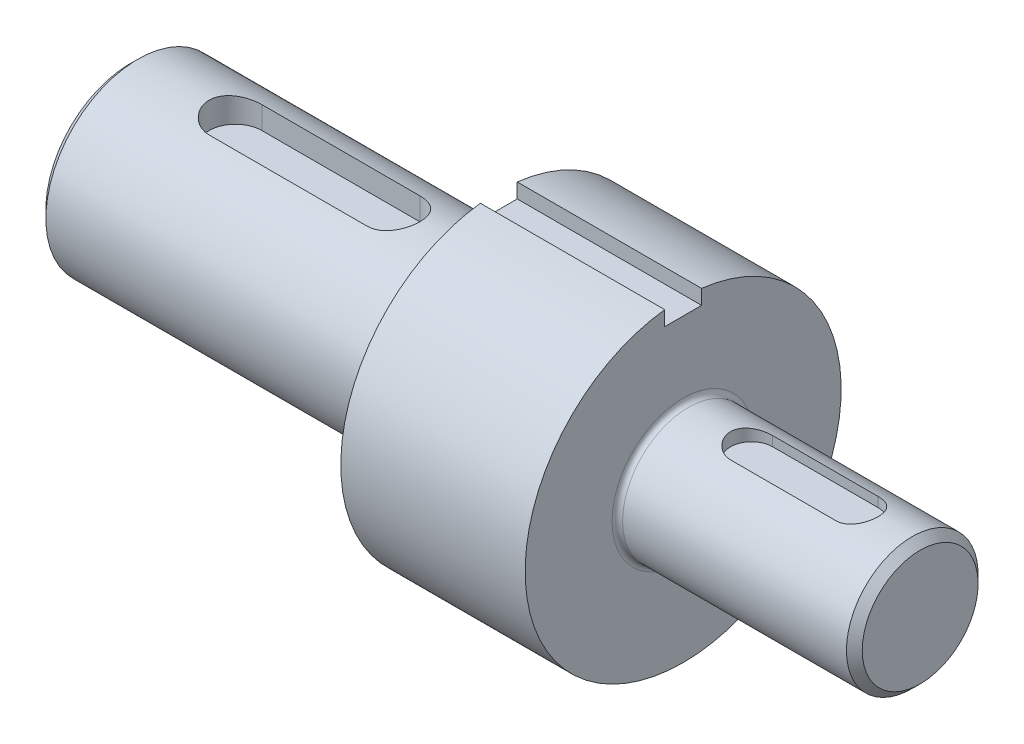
ISO-10303-21;
HEADER;
FILE_DESCRIPTION(('STEP AP214'),'2;1');
FILE_NAME('part.step','',(''),(''),'','','');
FILE_SCHEMA(('AUTOMOTIVE_DESIGN { 1 0 10303 214 1 1 1 1 }'));
ENDSEC;
DATA;
#1=APPLICATION_CONTEXT('core data for automotive mechanical design processes');
#2=APPLICATION_PROTOCOL_DEFINITION('international standard','automotive_design',2000,#1);
#3=PRODUCT_CONTEXT('',#1,'mechanical');
#4=PRODUCT('Part','Part','',(#3));
#5=PRODUCT_RELATED_PRODUCT_CATEGORY('part','',(#4));
#6=PRODUCT_DEFINITION_FORMATION('','',#4);
#7=PRODUCT_DEFINITION_CONTEXT('part definition',#1,'design');
#8=PRODUCT_DEFINITION('design','',#6,#7);
#9=PRODUCT_DEFINITION_SHAPE('','',#8);
#10=(LENGTH_UNIT() NAMED_UNIT(*) SI_UNIT(.MILLI.,.METRE.));
#11=(NAMED_UNIT(*) PLANE_ANGLE_UNIT() SI_UNIT($,.RADIAN.));
#12=(NAMED_UNIT(*) SI_UNIT($,.STERADIAN.) SOLID_ANGLE_UNIT());
#13=UNCERTAINTY_MEASURE_WITH_UNIT(LENGTH_MEASURE(1.E-05),#10,'distance_accuracy_value','');
#14=(GEOMETRIC_REPRESENTATION_CONTEXT(3) GLOBAL_UNCERTAINTY_ASSIGNED_CONTEXT((#13)) GLOBAL_UNIT_ASSIGNED_CONTEXT((#10,
#11,#12)) REPRESENTATION_CONTEXT('',''));
#15=CARTESIAN_POINT('',(0.,0.,0.));
#16=DIRECTION('',(0.,0.,1.));
#17=DIRECTION('',(1.,0.,0.));
#18=AXIS2_PLACEMENT_3D('',#15,#16,#17);
#19=CARTESIAN_POINT('',(0.,0.,0.));
#20=DIRECTION('',(-1.,0.,0.));
#21=DIRECTION('',(0.,0.,1.));
#22=AXIS2_PLACEMENT_3D('',#19,#20,#21);
#23=CYLINDRICAL_SURFACE('',#22,17.5);
#24=CARTESIAN_POINT('',(69.,0.,0.));
#25=DIRECTION('',(1.,0.,0.));
#26=DIRECTION('',(0.,0.,-1.));
#27=AXIS2_PLACEMENT_3D('',#24,#25,#26);
#28=CIRCLE('',#27,17.5);
#29=CARTESIAN_POINT('',(69.,0.,-17.5));
#30=VERTEX_POINT('',#29);
#31=EDGE_CURVE('E42',#30,#30,#28,.F.);
#32=ORIENTED_EDGE('',*,*,#31,.T.);
#33=EDGE_LOOP('',(#32));
#34=FACE_BOUND('',#33,.T.);
#35=CARTESIAN_POINT('',(1.50000000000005,0.,0.));
#36=DIRECTION('',(1.,0.,0.));
#37=DIRECTION('',(0.,0.,-1.));
#38=AXIS2_PLACEMENT_3D('',#35,#36,#37);
#39=CIRCLE('',#38,17.5);
#40=CARTESIAN_POINT('',(1.50000000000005,0.,-17.5));
#41=VERTEX_POINT('',#40);
#42=EDGE_CURVE('E298',#41,#41,#39,.T.);
#43=ORIENTED_EDGE('',*,*,#42,.T.);
#44=EDGE_LOOP('',(#43));
#45=FACE_BOUND('',#44,.T.);
#46=CARTESIAN_POINT('',(20.,16.7705098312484,-5.));
#47=CARTESIAN_POINT('',(19.8624562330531,16.7704912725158,-5.00001814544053));
#48=CARTESIAN_POINT('',(19.7249193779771,16.7722013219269,-4.99432529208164));
#49=CARTESIAN_POINT('',(19.4508888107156,16.7789431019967,-4.97165222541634));
#50=CARTESIAN_POINT('',(19.3143948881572,16.7839741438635,-4.95467435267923));
#51=CARTESIAN_POINT('',(19.0437415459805,16.7972068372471,-4.90961903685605));
#52=CARTESIAN_POINT('',(18.9095773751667,16.8054009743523,-4.88156789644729));
#53=CARTESIAN_POINT('',(18.6442003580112,16.8247046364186,-4.81461674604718));
#54=CARTESIAN_POINT('',(18.512987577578,16.8358142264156,-4.77571649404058));
#55=CARTESIAN_POINT('',(18.2544683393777,16.8606149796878,-4.68740449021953));
#56=CARTESIAN_POINT('',(18.1271599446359,16.874304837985,-4.63799805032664));
#57=CARTESIAN_POINT('',(17.8772006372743,16.9038705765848,-4.52905522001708));
#58=CARTESIAN_POINT('',(17.7545514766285,16.9197472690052,-4.46951506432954));
#59=CARTESIAN_POINT('',(17.394791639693,16.9699997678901,-4.27631278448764));
#60=CARTESIAN_POINT('',(17.1657016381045,17.007014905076,-4.12801150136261));
#61=CARTESIAN_POINT('',(16.7294860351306,17.0850471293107,-3.7922991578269));
#62=CARTESIAN_POINT('',(16.523079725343,17.1261428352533,-3.60397767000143));
#63=CARTESIAN_POINT('',(16.1442623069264,17.2070462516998,-3.19544341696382));
#64=CARTESIAN_POINT('',(15.971856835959,17.2468537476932,-2.97522537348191));
#65=CARTESIAN_POINT('',(15.6629219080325,17.3215844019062,-2.5041085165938));
#66=CARTESIAN_POINT('',(15.5271190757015,17.3564029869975,-2.25271539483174));
#67=CARTESIAN_POINT('',(15.2999922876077,17.4163145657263,-1.72950937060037));
#68=CARTESIAN_POINT('',(15.2086576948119,17.4414098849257,-1.45770136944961));
#69=CARTESIAN_POINT('',(15.0754142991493,17.4784878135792,-0.908899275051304));
#70=CARTESIAN_POINT('',(15.0322781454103,17.4907954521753,-0.632225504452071));
#71=CARTESIAN_POINT('',(14.9927833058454,17.5020523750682,-0.0753060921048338));
#72=CARTESIAN_POINT('',(14.9964166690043,17.5010039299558,0.204938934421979));
#73=CARTESIAN_POINT('',(15.0495154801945,17.4859002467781,0.75245137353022));
#74=CARTESIAN_POINT('',(15.0976523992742,17.4722220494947,1.0198597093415));
#75=CARTESIAN_POINT('',(15.2362408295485,17.433846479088,1.54263514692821));
#76=CARTESIAN_POINT('',(15.3266944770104,17.4091485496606,1.79800164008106));
#77=CARTESIAN_POINT('',(15.5482663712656,17.3509771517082,2.29267928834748));
#78=CARTESIAN_POINT('',(15.6798189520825,17.3174105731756,2.53178407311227));
#79=CARTESIAN_POINT('',(15.9796443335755,17.2450626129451,2.98504901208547));
#80=CARTESIAN_POINT('',(16.1479245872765,17.2062801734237,3.19920408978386));
#81=CARTESIAN_POINT('',(16.4276273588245,17.1465202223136,3.50113424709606));
#82=CARTESIAN_POINT('',(16.5273638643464,17.1259700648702,3.60007423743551));
#83=CARTESIAN_POINT('',(16.7348202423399,17.0851123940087,3.78923134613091));
#84=CARTESIAN_POINT('',(16.8425373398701,17.0648047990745,3.87945147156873));
#85=CARTESIAN_POINT('',(17.0653450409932,17.0249868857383,4.05062437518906));
#86=CARTESIAN_POINT('',(17.1804405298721,17.005477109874,4.13157091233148));
#87=CARTESIAN_POINT('',(17.417160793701,16.9678346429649,4.28353981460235));
#88=CARTESIAN_POINT('',(17.5387830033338,16.9497014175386,4.35456603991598));
#89=CARTESIAN_POINT('',(17.7889159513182,16.9151829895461,4.48679157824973));
#90=CARTESIAN_POINT('',(17.9174786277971,16.898814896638,4.5478971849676));
#91=CARTESIAN_POINT('',(18.17954149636,16.8685251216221,4.65898872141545));
#92=CARTESIAN_POINT('',(18.3130396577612,16.8546024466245,4.70897916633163));
#93=CARTESIAN_POINT('',(18.5839210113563,16.829649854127,4.79739484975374));
#94=CARTESIAN_POINT('',(18.7212999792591,16.8186169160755,4.83583217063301));
#95=CARTESIAN_POINT('',(18.9989955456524,16.7997865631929,4.90084834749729));
#96=CARTESIAN_POINT('',(19.1393107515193,16.7919876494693,4.92743269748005));
#97=CARTESIAN_POINT('',(19.3996651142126,16.7808301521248,4.96528740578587));
#98=CARTESIAN_POINT('',(19.5194316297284,16.776966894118,4.97830600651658));
#99=CARTESIAN_POINT('',(19.7594622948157,16.7718034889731,4.99566040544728));
#100=CARTESIAN_POINT('',(19.879725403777,16.7704994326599,5.00000944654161));
#101=CARTESIAN_POINT('',(20.,16.7705098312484,5.));
#102=B_SPLINE_CURVE_WITH_KNOTS('',3,(#46,#47,#48,#49,#50,#51,#52,#53,#54,#55,#56,#57,#58,#59,
#60,#61,#62,#63,#64,#65,#66,#67,#68,#69,#70,#71,#72,#73,#74,#75,#76,#77,#78,#79,#80,#81,#82,#83,
#84,#85,#86,#87,#88,#89,#90,#91,#92,#93,#94,#95,#96,#97,#98,#99,#100,#101),.UNSPECIFIED.,.F.,
.F.,(4,2,2,2,2,2,2,2,2,2,2,2,2,2,2,2,2,2,2,2,2,2,2,2,2,2,2,4),(0.,0.412492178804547,
0.824898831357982,1.23633171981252,1.64777378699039,2.05900832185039,2.47039598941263,
3.29264569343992,4.13611232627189,4.9797186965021,5.83900986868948,6.69809539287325,
7.53476732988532,8.3712970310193,9.18363381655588,9.99601161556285,10.8172828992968,
11.6387209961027,12.0642579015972,12.489647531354,12.9153217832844,13.3408299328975,
13.7701489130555,14.1992931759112,14.6279870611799,15.056482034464,15.4177510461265,
15.7784677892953),.UNSPECIFIED.);
#103=CARTESIAN_POINT('',(20.,16.7705098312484,-5.));
#104=VERTEX_POINT('',#103);
#105=CARTESIAN_POINT('',(20.,16.7705098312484,5.));
#106=VERTEX_POINT('',#105);
#107=EDGE_CURVE('E130',#104,#106,#102,.T.);
#108=ORIENTED_EDGE('',*,*,#107,.F.);
#109=DIRECTION('',(-1.,0.,0.));
#110=VECTOR('',#109,1.);
#111=CARTESIAN_POINT('',(0.,16.7705098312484,-5.));
#112=LINE('',#111,#110);
#113=CARTESIAN_POINT('',(50.,16.7705098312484,-5.));
#114=VERTEX_POINT('',#113);
#115=EDGE_CURVE('E261',#114,#104,#112,.T.);
#116=ORIENTED_EDGE('',*,*,#115,.F.);
#117=CARTESIAN_POINT('',(50.,16.7705098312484,5.));
#118=CARTESIAN_POINT('',(50.1375437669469,16.7704912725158,5.00001814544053));
#119=CARTESIAN_POINT('',(50.2750806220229,16.7722013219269,4.99432529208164));
#120=CARTESIAN_POINT('',(50.5491111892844,16.7789431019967,4.97165222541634));
#121=CARTESIAN_POINT('',(50.6856051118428,16.7839741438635,4.95467435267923));
#122=CARTESIAN_POINT('',(50.9562584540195,16.7972068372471,4.90961903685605));
#123=CARTESIAN_POINT('',(51.0904226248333,16.8054009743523,4.88156789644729));
#124=CARTESIAN_POINT('',(51.3557996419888,16.8247046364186,4.81461674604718));
#125=CARTESIAN_POINT('',(51.487012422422,16.8358142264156,4.77571649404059));
#126=CARTESIAN_POINT('',(51.7455316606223,16.8606149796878,4.68740449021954));
#127=CARTESIAN_POINT('',(51.872840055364,16.874304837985,4.63799805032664));
#128=CARTESIAN_POINT('',(52.1227993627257,16.9038705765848,4.52905522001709));
#129=CARTESIAN_POINT('',(52.2454485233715,16.9197472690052,4.46951506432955));
#130=CARTESIAN_POINT('',(52.605208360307,16.9699997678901,4.27631278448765));
#131=CARTESIAN_POINT('',(52.8342983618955,17.007014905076,4.12801150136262));
#132=CARTESIAN_POINT('',(53.2705139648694,17.0850471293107,3.79229915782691));
#133=CARTESIAN_POINT('',(53.476920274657,17.1261428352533,3.60397767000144));
#134=CARTESIAN_POINT('',(53.8557376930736,17.2070462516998,3.19544341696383));
#135=CARTESIAN_POINT('',(54.028143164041,17.2468537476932,2.97522537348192));
#136=CARTESIAN_POINT('',(54.3370780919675,17.3215844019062,2.5041085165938));
#137=CARTESIAN_POINT('',(54.4728809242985,17.3564029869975,2.25271539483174));
#138=CARTESIAN_POINT('',(54.7000077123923,17.4163145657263,1.72950937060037));
#139=CARTESIAN_POINT('',(54.7913423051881,17.4414098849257,1.45770136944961));
#140=CARTESIAN_POINT('',(54.9245857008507,17.4784878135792,0.908899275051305));
#141=CARTESIAN_POINT('',(54.9677218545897,17.4907954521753,0.632225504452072));
#142=CARTESIAN_POINT('',(55.0072166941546,17.5020523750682,0.0753060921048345));
#143=CARTESIAN_POINT('',(55.0035833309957,17.5010039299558,-0.204938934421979));
#144=CARTESIAN_POINT('',(54.9504845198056,17.4859002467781,-0.752451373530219));
#145=CARTESIAN_POINT('',(54.9023476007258,17.4722220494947,-1.0198597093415));
#146=CARTESIAN_POINT('',(54.7637591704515,17.433846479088,-1.54263514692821));
#147=CARTESIAN_POINT('',(54.6733055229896,17.4091485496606,-1.79800164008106));
#148=CARTESIAN_POINT('',(54.4517336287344,17.3509771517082,-2.29267928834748));
#149=CARTESIAN_POINT('',(54.3201810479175,17.3174105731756,-2.53178407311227));
#150=CARTESIAN_POINT('',(54.0203556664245,17.2450626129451,-2.98504901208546));
#151=CARTESIAN_POINT('',(53.8520754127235,17.2062801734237,-3.19920408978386));
#152=CARTESIAN_POINT('',(53.5723726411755,17.1465202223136,-3.50113424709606));
#153=CARTESIAN_POINT('',(53.4726361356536,17.1259700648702,-3.60007423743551));
#154=CARTESIAN_POINT('',(53.2651797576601,17.0851123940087,-3.78923134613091));
#155=CARTESIAN_POINT('',(53.1574626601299,17.0648047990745,-3.87945147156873));
#156=CARTESIAN_POINT('',(52.9346549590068,17.0249868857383,-4.05062437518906));
#157=CARTESIAN_POINT('',(52.8195594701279,17.005477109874,-4.13157091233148));
#158=CARTESIAN_POINT('',(52.582839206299,16.9678346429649,-4.28353981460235));
#159=CARTESIAN_POINT('',(52.4612169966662,16.9497014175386,-4.35456603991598));
#160=CARTESIAN_POINT('',(52.2110840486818,16.9151829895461,-4.48679157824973));
#161=CARTESIAN_POINT('',(52.0825213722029,16.898814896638,-4.5478971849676));
#162=CARTESIAN_POINT('',(51.82045850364,16.8685251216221,-4.65898872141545));
#163=CARTESIAN_POINT('',(51.6869603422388,16.8546024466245,-4.70897916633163));
#164=CARTESIAN_POINT('',(51.4160789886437,16.829649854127,-4.79739484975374));
#165=CARTESIAN_POINT('',(51.2787000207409,16.8186169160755,-4.83583217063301));
#166=CARTESIAN_POINT('',(51.0010044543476,16.7997865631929,-4.90084834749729));
#167=CARTESIAN_POINT('',(50.8606892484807,16.7919876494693,-4.92743269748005));
#168=CARTESIAN_POINT('',(50.6003348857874,16.7808301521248,-4.96528740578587));
#169=CARTESIAN_POINT('',(50.4805683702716,16.776966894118,-4.97830600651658));
#170=CARTESIAN_POINT('',(50.2405377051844,16.7718034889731,-4.99566040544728));
#171=CARTESIAN_POINT('',(50.120274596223,16.7704994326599,-5.00000944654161));
#172=CARTESIAN_POINT('',(50.,16.7705098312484,-5.));
#173=B_SPLINE_CURVE_WITH_KNOTS('',3,(#117,#118,#119,#120,#121,#122,#123,#124,#125,#126,#127,
#128,#129,#130,#131,#132,#133,#134,#135,#136,#137,#138,#139,#140,#141,#142,#143,#144,#145,#146,
#147,#148,#149,#150,#151,#152,#153,#154,#155,#156,#157,#158,#159,#160,#161,#162,#163,#164,#165,
#166,#167,#168,#169,#170,#171,#172),.UNSPECIFIED.,.F.,.F.,(4,2,2,2,2,2,2,2,2,2,2,2,2,2,2,2,2,2,
2,2,2,2,2,2,2,2,2,4),(0.,0.412492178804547,0.824898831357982,1.23633171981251,1.64777378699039,
2.05900832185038,2.47039598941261,3.29264569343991,4.13611232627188,4.9797186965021,
5.83900986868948,6.69809539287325,7.53476732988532,8.3712970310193,9.18363381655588,
9.99601161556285,10.8172828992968,11.6387209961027,12.0642579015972,12.489647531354,
12.9153217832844,13.3408299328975,13.7701489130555,14.1992931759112,14.6279870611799,
15.056482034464,15.4177510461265,15.7784677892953),.UNSPECIFIED.);
#174=CARTESIAN_POINT('',(50.,16.7705098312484,5.));
#175=VERTEX_POINT('',#174);
#176=EDGE_CURVE('E263',#175,#114,#173,.T.);
#177=ORIENTED_EDGE('',*,*,#176,.F.);
#178=DIRECTION('',(-1.,0.,0.));
#179=VECTOR('',#178,1.);
#180=CARTESIAN_POINT('',(0.,16.7705098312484,5.));
#181=LINE('',#180,#179);
#182=EDGE_CURVE('E271',#106,#175,#181,.F.);
#183=ORIENTED_EDGE('',*,*,#182,.F.);
#184=EDGE_LOOP('',(#108,#116,#177,#183));
#185=FACE_BOUND('',#184,.T.);
#186=ADVANCED_FACE('F34',(#34,#45,#185),#23,.T.);
#187=CARTESIAN_POINT('',(0.,0.,0.));
#188=DIRECTION('',(-1.,0.,0.));
#189=DIRECTION('',(0.,0.,1.));
#190=AXIS2_PLACEMENT_3D('',#187,#188,#189);
#191=CYLINDRICAL_SURFACE('',#190,12.5);
#192=CARTESIAN_POINT('',(106.,0.,0.));
#193=DIRECTION('',(-1.,0.,0.));
#194=DIRECTION('',(0.,0.,1.));
#195=AXIS2_PLACEMENT_3D('',#192,#193,#194);
#196=CIRCLE('',#195,12.5);
#197=CARTESIAN_POINT('',(106.,0.,12.5));
#198=VERTEX_POINT('',#197);
#199=EDGE_CURVE('E258',#198,#198,#196,.F.);
#200=ORIENTED_EDGE('',*,*,#199,.T.);
#201=EDGE_LOOP('',(#200));
#202=FACE_BOUND('',#201,.T.);
#203=CARTESIAN_POINT('',(148.5,0.,0.));
#204=DIRECTION('',(-1.,0.,0.));
#205=DIRECTION('',(0.,0.,1.));
#206=AXIS2_PLACEMENT_3D('',#203,#204,#205);
#207=CIRCLE('',#206,12.5);
#208=CARTESIAN_POINT('',(148.5,0.,12.5));
#209=VERTEX_POINT('',#208);
#210=EDGE_CURVE('E249',#209,#209,#207,.T.);
#211=ORIENTED_EDGE('',*,*,#210,.T.);
#212=EDGE_LOOP('',(#211));
#213=FACE_BOUND('',#212,.T.);
#214=CARTESIAN_POINT('',(118.,11.842719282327,-4.));
#215=CARTESIAN_POINT('',(117.890600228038,11.8427027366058,-4.00001410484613));
#216=CARTESIAN_POINT('',(117.781209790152,11.8442348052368,-3.995512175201));
#217=CARTESIAN_POINT('',(117.563271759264,11.8502730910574,-3.97758606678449));
#218=CARTESIAN_POINT('',(117.454723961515,11.8547785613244,-3.96416412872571));
#219=CARTESIAN_POINT('',(117.239538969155,11.8666242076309,-3.9285572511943));
#220=CARTESIAN_POINT('',(117.132897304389,11.8739564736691,-3.9063967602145));
#221=CARTESIAN_POINT('',(116.921994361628,11.8912164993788,-3.85353581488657));
#222=CARTESIAN_POINT('',(116.817733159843,11.90114434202,-3.82283508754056));
#223=CARTESIAN_POINT('',(116.509694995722,11.9343840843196,-3.71831764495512));
#224=CARTESIAN_POINT('',(116.310363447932,11.9611699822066,-3.63203544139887));
#225=CARTESIAN_POINT('',(115.928987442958,12.0209583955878,-3.42895021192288));
#226=CARTESIAN_POINT('',(115.74695262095,12.0539643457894,-3.31213030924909));
#227=CARTESIAN_POINT('',(115.398746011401,12.123798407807,-3.0467850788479));
#228=CARTESIAN_POINT('',(115.233281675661,12.1607158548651,-2.89735303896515));
#229=CARTESIAN_POINT('',(114.929285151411,12.2334561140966,-2.57296449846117));
#230=CARTESIAN_POINT('',(114.790757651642,12.2692787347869,-2.39800356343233));
#231=CARTESIAN_POINT('',(114.541384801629,12.3368244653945,-2.02237003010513));
#232=CARTESIAN_POINT('',(114.43127804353,12.3684294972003,-1.82118394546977));
#233=CARTESIAN_POINT('',(114.246750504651,12.4229251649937,-1.4019719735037));
#234=CARTESIAN_POINT('',(114.172319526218,12.4458182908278,-1.18395091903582));
#235=CARTESIAN_POINT('',(114.06364113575,12.4796767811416,-0.744713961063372));
#236=CARTESIAN_POINT('',(114.02817506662,12.4910030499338,-0.523827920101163));
#237=CARTESIAN_POINT('',(113.994567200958,12.5017287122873,-0.0789648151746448));
#238=CARTESIAN_POINT('',(113.996417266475,12.5011307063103,0.145011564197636));
#239=CARTESIAN_POINT('',(114.036598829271,12.4883236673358,0.581094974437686));
#240=CARTESIAN_POINT('',(114.073607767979,12.4765355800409,0.793338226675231));
#241=CARTESIAN_POINT('',(114.180880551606,12.443194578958,1.2084232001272));
#242=CARTESIAN_POINT('',(114.251146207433,12.4216411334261,1.41126440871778));
#243=CARTESIAN_POINT('',(114.423757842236,12.3706364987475,1.80478548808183));
#244=CARTESIAN_POINT('',(114.526496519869,12.3410893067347,1.99528012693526));
#245=CARTESIAN_POINT('',(114.760829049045,12.2771965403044,2.35673113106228));
#246=CARTESIAN_POINT('',(114.892430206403,12.2428497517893,2.5276825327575));
#247=CARTESIAN_POINT('',(115.187446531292,12.1712409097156,2.8530451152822));
#248=CARTESIAN_POINT('',(115.351996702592,12.1339170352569,3.00641313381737));
#249=CARTESIAN_POINT('',(115.704971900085,12.0618172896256,3.28377291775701));
#250=CARTESIAN_POINT('',(115.893404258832,12.0270422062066,3.40775562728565));
#251=CARTESIAN_POINT('',(116.191371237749,11.9796198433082,3.56958208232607));
#252=CARTESIAN_POINT('',(116.293999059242,11.9645161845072,3.61975674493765));
#253=CARTESIAN_POINT('',(116.503404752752,11.9364591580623,3.71123075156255));
#254=CARTESIAN_POINT('',(116.610180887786,11.9235049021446,3.75253376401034));
#255=CARTESIAN_POINT('',(116.827013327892,11.9001802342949,3.82585831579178));
#256=CARTESIAN_POINT('',(116.937065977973,11.889807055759,3.85788979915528));
#257=CARTESIAN_POINT('',(117.159695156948,11.8719756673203,3.91241790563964));
#258=CARTESIAN_POINT('',(117.272270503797,11.8645161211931,3.93491889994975));
#259=CARTESIAN_POINT('',(117.487239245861,11.8533815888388,3.96832908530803));
#260=CARTESIAN_POINT('',(117.589467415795,11.8493925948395,3.9802038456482));
#261=CARTESIAN_POINT('',(117.794461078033,11.8440568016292,3.99603937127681));
#262=CARTESIAN_POINT('',(117.897225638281,11.8427063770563,4.00001099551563));
#263=CARTESIAN_POINT('',(118.,11.842719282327,4.));
#264=B_SPLINE_CURVE_WITH_KNOTS('',3,(#214,#215,#216,#217,#218,#219,#220,#221,#222,#223,#224,
#225,#226,#227,#228,#229,#230,#231,#232,#233,#234,#235,#236,#237,#238,#239,#240,#241,#242,#243,
#244,#245,#246,#247,#248,#249,#250,#251,#252,#253,#254,#255,#256,#257,#258,#259,#260,#261,#262,
#263),.UNSPECIFIED.,.F.,.F.,(4,2,2,2,2,2,2,2,2,2,2,2,2,2,2,2,2,2,2,2,2,2,2,2,4),(0.,
0.328080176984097,0.656077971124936,0.983164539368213,1.31026156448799,1.96355293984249,
2.61720612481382,3.29209427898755,3.96709980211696,4.65819584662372,5.34909422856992,
6.01770820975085,6.68617638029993,7.3304550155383,7.97476873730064,8.62719320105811,
9.27978300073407,9.96076419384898,10.6419549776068,10.9872862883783,11.3324745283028,
11.6772911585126,12.0219494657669,12.3305938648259,12.6388138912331),.UNSPECIFIED.);
#265=CARTESIAN_POINT('',(118.,11.842719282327,-4.));
#266=VERTEX_POINT('',#265);
#267=CARTESIAN_POINT('',(118.,11.842719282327,4.));
#268=VERTEX_POINT('',#267);
#269=EDGE_CURVE('E243',#266,#268,#264,.T.);
#270=ORIENTED_EDGE('',*,*,#269,.F.);
#271=DIRECTION('',(-1.,0.,0.));
#272=VECTOR('',#271,1.);
#273=CARTESIAN_POINT('',(0.,11.842719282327,-4.));
#274=LINE('',#273,#272);
#275=CARTESIAN_POINT('',(138.,11.842719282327,-4.));
#276=VERTEX_POINT('',#275);
#277=EDGE_CURVE('E207',#276,#266,#274,.T.);
#278=ORIENTED_EDGE('',*,*,#277,.F.);
#279=CARTESIAN_POINT('',(138.,11.842719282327,4.));
#280=CARTESIAN_POINT('',(138.109399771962,11.8427027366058,4.00001410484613));
#281=CARTESIAN_POINT('',(138.218790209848,11.8442348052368,3.995512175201));
#282=CARTESIAN_POINT('',(138.436728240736,11.8502730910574,3.97758606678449));
#283=CARTESIAN_POINT('',(138.545276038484,11.8547785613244,3.96416412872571));
#284=CARTESIAN_POINT('',(138.760461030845,11.8666242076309,3.9285572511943));
#285=CARTESIAN_POINT('',(138.867102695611,11.8739564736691,3.9063967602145));
#286=CARTESIAN_POINT('',(139.078005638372,11.8912164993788,3.85353581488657));
#287=CARTESIAN_POINT('',(139.182266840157,11.90114434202,3.82283508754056));
#288=CARTESIAN_POINT('',(139.490305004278,11.9343840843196,3.71831764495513));
#289=CARTESIAN_POINT('',(139.689636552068,11.9611699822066,3.6320354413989));
#290=CARTESIAN_POINT('',(140.071012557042,12.0209583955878,3.42895021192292));
#291=CARTESIAN_POINT('',(140.25304737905,12.0539643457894,3.31213030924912));
#292=CARTESIAN_POINT('',(140.601253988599,12.123798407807,3.04678507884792));
#293=CARTESIAN_POINT('',(140.766718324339,12.1607158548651,2.89735303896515));
#294=CARTESIAN_POINT('',(141.070714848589,12.2334561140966,2.57296449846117));
#295=CARTESIAN_POINT('',(141.209242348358,12.2692787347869,2.39800356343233));
#296=CARTESIAN_POINT('',(141.458615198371,12.3368244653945,2.02237003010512));
#297=CARTESIAN_POINT('',(141.56872195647,12.3684294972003,1.82118394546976));
#298=CARTESIAN_POINT('',(141.753249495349,12.4229251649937,1.40197197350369));
#299=CARTESIAN_POINT('',(141.827680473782,12.4458182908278,1.18395091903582));
#300=CARTESIAN_POINT('',(141.93635886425,12.4796767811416,0.744713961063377));
#301=CARTESIAN_POINT('',(141.97182493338,12.4910030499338,0.523827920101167));
#302=CARTESIAN_POINT('',(142.005432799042,12.5017287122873,0.0789648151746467));
#303=CARTESIAN_POINT('',(142.003582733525,12.5011307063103,-0.145011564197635));
#304=CARTESIAN_POINT('',(141.963401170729,12.4883236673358,-0.581094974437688));
#305=CARTESIAN_POINT('',(141.926392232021,12.4765355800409,-0.793338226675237));
#306=CARTESIAN_POINT('',(141.819119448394,12.443194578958,-1.2084232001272));
#307=CARTESIAN_POINT('',(141.748853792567,12.4216411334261,-1.41126440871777));
#308=CARTESIAN_POINT('',(141.576242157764,12.3706364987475,-1.80478548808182));
#309=CARTESIAN_POINT('',(141.473503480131,12.3410893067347,-1.99528012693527));
#310=CARTESIAN_POINT('',(141.239170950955,12.2771965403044,-2.35673113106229));
#311=CARTESIAN_POINT('',(141.107569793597,12.2428497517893,-2.5276825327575));
#312=CARTESIAN_POINT('',(140.812553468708,12.1712409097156,-2.8530451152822));
#313=CARTESIAN_POINT('',(140.648003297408,12.1339170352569,-3.00641313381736));
#314=CARTESIAN_POINT('',(140.295028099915,12.0618172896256,-3.283772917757));
#315=CARTESIAN_POINT('',(140.106595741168,12.0270422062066,-3.40775562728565));
#316=CARTESIAN_POINT('',(139.808628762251,11.9796198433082,-3.56958208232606));
#317=CARTESIAN_POINT('',(139.706000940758,11.9645161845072,-3.61975674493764));
#318=CARTESIAN_POINT('',(139.496595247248,11.9364591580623,-3.71123075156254));
#319=CARTESIAN_POINT('',(139.389819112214,11.9235049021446,-3.75253376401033));
#320=CARTESIAN_POINT('',(139.172986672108,11.9001802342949,-3.82585831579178));
#321=CARTESIAN_POINT('',(139.062934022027,11.889807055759,-3.85788979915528));
#322=CARTESIAN_POINT('',(138.840304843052,11.8719756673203,-3.91241790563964));
#323=CARTESIAN_POINT('',(138.727729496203,11.8645161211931,-3.93491889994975));
#324=CARTESIAN_POINT('',(138.512760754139,11.8533815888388,-3.96832908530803));
#325=CARTESIAN_POINT('',(138.410532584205,11.8493925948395,-3.9802038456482));
#326=CARTESIAN_POINT('',(138.205538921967,11.8440568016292,-3.99603937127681));
#327=CARTESIAN_POINT('',(138.102774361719,11.8427063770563,-4.00001099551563));
#328=CARTESIAN_POINT('',(138.,11.842719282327,-4.));
#329=B_SPLINE_CURVE_WITH_KNOTS('',3,(#279,#280,#281,#282,#283,#284,#285,#286,#287,#288,#289,
#290,#291,#292,#293,#294,#295,#296,#297,#298,#299,#300,#301,#302,#303,#304,#305,#306,#307,#308,
#309,#310,#311,#312,#313,#314,#315,#316,#317,#318,#319,#320,#321,#322,#323,#324,#325,#326,#327,
#328),.UNSPECIFIED.,.F.,.F.,(4,2,2,2,2,2,2,2,2,2,2,2,2,2,2,2,2,2,2,2,2,2,2,2,4),(0.,
0.328080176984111,0.656077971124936,0.983164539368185,1.31026156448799,1.96355293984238,
2.61720612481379,3.29209427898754,3.96709980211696,4.65819584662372,5.34909422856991,
6.01770820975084,6.68617638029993,7.33045501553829,7.97476873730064,8.62719320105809,
9.27978300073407,9.96076419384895,10.6419549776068,10.9872862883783,11.3324745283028,
11.6772911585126,12.0219494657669,12.3305938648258,12.6388138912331),.UNSPECIFIED.);
#330=CARTESIAN_POINT('',(138.,11.842719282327,4.));
#331=VERTEX_POINT('',#330);
#332=EDGE_CURVE('E209',#331,#276,#329,.T.);
#333=ORIENTED_EDGE('',*,*,#332,.F.);
#334=DIRECTION('',(-1.,0.,0.));
#335=VECTOR('',#334,1.);
#336=CARTESIAN_POINT('',(0.,11.842719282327,3.99999999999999));
#337=LINE('',#336,#335);
#338=EDGE_CURVE('E217',#268,#331,#337,.F.);
#339=ORIENTED_EDGE('',*,*,#338,.F.);
#340=EDGE_LOOP('',(#270,#278,#333,#339));
#341=FACE_BOUND('',#340,.T.);
#342=ADVANCED_FACE('F219',(#202,#213,#341),#191,.T.);
#343=CARTESIAN_POINT('',(0.,0.,0.));
#344=DIRECTION('',(1.,0.,0.));
#345=DIRECTION('',(0.,0.,-1.));
#346=AXIS2_PLACEMENT_3D('',#343,#344,#345);
#347=PLANE('',#346);
#348=CARTESIAN_POINT('',(0.,0.,0.));
#349=DIRECTION('',(1.,0.,0.));
#350=DIRECTION('',(0.,0.,-1.));
#351=AXIS2_PLACEMENT_3D('',#348,#349,#350);
#352=CIRCLE('',#351,16.);
#353=CARTESIAN_POINT('',(0.,0.,-16.));
#354=VERTEX_POINT('',#353);
#355=EDGE_CURVE('E295',#354,#354,#352,.F.);
#356=ORIENTED_EDGE('',*,*,#355,.T.);
#357=EDGE_LOOP('',(#356));
#358=FACE_BOUND('',#357,.T.);
#359=ADVANCED_FACE('F317',(#358),#347,.F.);
#360=CARTESIAN_POINT('',(70.,17.5,0.));
#361=DIRECTION('',(1.,0.,0.));
#362=DIRECTION('',(0.,0.,-1.));
#363=AXIS2_PLACEMENT_3D('',#360,#361,#362);
#364=PLANE('',#363);
#365=CARTESIAN_POINT('',(70.,0.,0.));
#366=DIRECTION('',(1.,0.,0.));
#367=DIRECTION('',(0.,0.,-1.));
#368=AXIS2_PLACEMENT_3D('',#365,#366,#367);
#369=CIRCLE('',#368,18.5);
#370=CARTESIAN_POINT('',(70.,0.,-18.5));
#371=VERTEX_POINT('',#370);
#372=EDGE_CURVE('E11',#371,#371,#369,.T.);
#373=ORIENTED_EDGE('',*,*,#372,.T.);
#374=EDGE_LOOP('',(#373));
#375=FACE_BOUND('',#374,.T.);
#376=DIRECTION('',(0.,0.,-1.));
#377=VECTOR('',#376,1.);
#378=CARTESIAN_POINT('',(70.,27.,0.));
#379=LINE('',#378,#377);
#380=CARTESIAN_POINT('',(70.,27.,3.5));
#381=VERTEX_POINT('',#380);
#382=CARTESIAN_POINT('',(70.,27.,-3.5));
#383=VERTEX_POINT('',#382);
#384=EDGE_CURVE('E189',#381,#383,#379,.T.);
#385=ORIENTED_EDGE('',*,*,#384,.T.);
#386=DIRECTION('',(0.,1.,0.));
#387=VECTOR('',#386,1.);
#388=CARTESIAN_POINT('',(70.,17.5,-3.5));
#389=LINE('',#388,#387);
#390=CARTESIAN_POINT('',(70.,29.7951338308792,-3.5));
#391=VERTEX_POINT('',#390);
#392=EDGE_CURVE('E195',#383,#391,#389,.T.);
#393=ORIENTED_EDGE('',*,*,#392,.T.);
#394=CARTESIAN_POINT('',(70.,0.,0.));
#395=DIRECTION('',(-1.,0.,0.));
#396=DIRECTION('',(0.,0.,1.));
#397=AXIS2_PLACEMENT_3D('',#394,#395,#396);
#398=CIRCLE('',#397,30.);
#399=CARTESIAN_POINT('',(70.,29.7951338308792,3.5));
#400=VERTEX_POINT('',#399);
#401=EDGE_CURVE('E201',#391,#400,#398,.T.);
#402=ORIENTED_EDGE('',*,*,#401,.T.);
#403=DIRECTION('',(0.,-1.,0.));
#404=VECTOR('',#403,1.);
#405=CARTESIAN_POINT('',(70.,17.5,3.5));
#406=LINE('',#405,#404);
#407=EDGE_CURVE('E186',#400,#381,#406,.T.);
#408=ORIENTED_EDGE('',*,*,#407,.T.);
#409=EDGE_LOOP('',(#385,#393,#402,#408));
#410=FACE_BOUND('',#409,.T.);
#411=ADVANCED_FACE('F322',(#375,#410),#364,.F.);
#412=CARTESIAN_POINT('',(0.,0.,0.));
#413=DIRECTION('',(-1.,0.,0.));
#414=DIRECTION('',(0.,0.,1.));
#415=AXIS2_PLACEMENT_3D('',#412,#413,#414);
#416=CYLINDRICAL_SURFACE('',#415,30.);
#417=ORIENTED_EDGE('',*,*,#401,.F.);
#418=DIRECTION('',(-1.,0.,0.));
#419=VECTOR('',#418,1.);
#420=CARTESIAN_POINT('',(0.,29.7951338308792,-3.5));
#421=LINE('',#420,#419);
#422=CARTESIAN_POINT('',(105.,29.7951338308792,-3.5));
#423=VERTEX_POINT('',#422);
#424=EDGE_CURVE('E192',#391,#423,#421,.F.);
#425=ORIENTED_EDGE('',*,*,#424,.T.);
#426=CARTESIAN_POINT('',(105.,0.,0.));
#427=DIRECTION('',(-1.,0.,0.));
#428=DIRECTION('',(0.,0.,1.));
#429=AXIS2_PLACEMENT_3D('',#426,#427,#428);
#430=CIRCLE('',#429,30.);
#431=CARTESIAN_POINT('',(105.,29.7951338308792,3.5));
#432=VERTEX_POINT('',#431);
#433=EDGE_CURVE('E198',#423,#432,#430,.T.);
#434=ORIENTED_EDGE('',*,*,#433,.T.);
#435=DIRECTION('',(-1.,0.,0.));
#436=VECTOR('',#435,1.);
#437=CARTESIAN_POINT('',(0.,29.7951338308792,3.5));
#438=LINE('',#437,#436);
#439=EDGE_CURVE('E182',#432,#400,#438,.T.);
#440=ORIENTED_EDGE('',*,*,#439,.T.);
#441=EDGE_LOOP('',(#417,#425,#434,#440));
#442=FACE_BOUND('',#441,.T.);
#443=ADVANCED_FACE('F373',(#442),#416,.T.);
#444=CARTESIAN_POINT('',(105.,30.,0.));
#445=DIRECTION('',(-1.,0.,0.));
#446=DIRECTION('',(0.,0.,1.));
#447=AXIS2_PLACEMENT_3D('',#444,#445,#446);
#448=PLANE('',#447);
#449=CARTESIAN_POINT('',(105.,0.,0.));
#450=DIRECTION('',(-1.,0.,0.));
#451=DIRECTION('',(0.,0.,1.));
#452=AXIS2_PLACEMENT_3D('',#449,#450,#451);
#453=CIRCLE('',#452,13.5);
#454=CARTESIAN_POINT('',(105.,0.,13.5));
#455=VERTEX_POINT('',#454);
#456=EDGE_CURVE('E255',#455,#455,#453,.T.);
#457=ORIENTED_EDGE('',*,*,#456,.T.);
#458=EDGE_LOOP('',(#457));
#459=FACE_BOUND('',#458,.T.);
#460=ORIENTED_EDGE('',*,*,#433,.F.);
#461=DIRECTION('',(0.,1.,0.));
#462=VECTOR('',#461,1.);
#463=CARTESIAN_POINT('',(105.,33.,-3.5));
#464=LINE('',#463,#462);
#465=CARTESIAN_POINT('',(105.,27.,-3.5));
#466=VERTEX_POINT('',#465);
#467=EDGE_CURVE('E174',#466,#423,#464,.T.);
#468=ORIENTED_EDGE('',*,*,#467,.F.);
#469=DIRECTION('',(0.,0.,-1.));
#470=VECTOR('',#469,1.);
#471=CARTESIAN_POINT('',(105.,27.,3.5));
#472=LINE('',#471,#470);
#473=CARTESIAN_POINT('',(105.,27.,3.5));
#474=VERTEX_POINT('',#473);
#475=EDGE_CURVE('E176',#474,#466,#472,.T.);
#476=ORIENTED_EDGE('',*,*,#475,.F.);
#477=DIRECTION('',(0.,1.,0.));
#478=VECTOR('',#477,1.);
#479=CARTESIAN_POINT('',(105.,30.,3.5));
#480=LINE('',#479,#478);
#481=EDGE_CURVE('E204',#474,#432,#480,.T.);
#482=ORIENTED_EDGE('',*,*,#481,.T.);
#483=EDGE_LOOP('',(#460,#468,#476,#482));
#484=FACE_BOUND('',#483,.T.);
#485=ADVANCED_FACE('F366',(#459,#484),#448,.F.);
#486=CARTESIAN_POINT('',(150.,12.5,0.));
#487=DIRECTION('',(-1.,0.,0.));
#488=DIRECTION('',(0.,0.,1.));
#489=AXIS2_PLACEMENT_3D('',#486,#487,#488);
#490=PLANE('',#489);
#491=CARTESIAN_POINT('',(150.,0.,0.));
#492=DIRECTION('',(-1.,0.,0.));
#493=DIRECTION('',(0.,0.,1.));
#494=AXIS2_PLACEMENT_3D('',#491,#492,#493);
#495=CIRCLE('',#494,11.);
#496=CARTESIAN_POINT('',(150.,0.,11.));
#497=VERTEX_POINT('',#496);
#498=EDGE_CURVE('E252',#497,#497,#495,.F.);
#499=ORIENTED_EDGE('',*,*,#498,.T.);
#500=EDGE_LOOP('',(#499));
#501=FACE_BOUND('',#500,.T.);
#502=ADVANCED_FACE('F363',(#501),#490,.F.);
#503=CARTESIAN_POINT('',(0.,33.,-3.5));
#504=DIRECTION('',(0.,0.,-1.));
#505=DIRECTION('',(-1.,0.,0.));
#506=AXIS2_PLACEMENT_3D('',#503,#504,#505);
#507=PLANE('',#506);
#508=DIRECTION('',(1.,0.,0.));
#509=VECTOR('',#508,1.);
#510=CARTESIAN_POINT('',(0.,27.,-3.5));
#511=LINE('',#510,#509);
#512=EDGE_CURVE('E180',#383,#466,#511,.T.);
#513=ORIENTED_EDGE('',*,*,#512,.T.);
#514=ORIENTED_EDGE('',*,*,#467,.T.);
#515=ORIENTED_EDGE('',*,*,#424,.F.);
#516=ORIENTED_EDGE('',*,*,#392,.F.);
#517=EDGE_LOOP('',(#513,#514,#515,#516));
#518=FACE_BOUND('',#517,.T.);
#519=ADVANCED_FACE('F365',(#518),#507,.F.);
#520=CARTESIAN_POINT('',(0.,27.,3.5));
#521=DIRECTION('',(0.,-1.,0.));
#522=DIRECTION('',(0.,0.,-1.));
#523=AXIS2_PLACEMENT_3D('',#520,#521,#522);
#524=PLANE('',#523);
#525=DIRECTION('',(1.,0.,0.));
#526=VECTOR('',#525,1.);
#527=CARTESIAN_POINT('',(0.,27.,3.5));
#528=LINE('',#527,#526);
#529=EDGE_CURVE('E179',#381,#474,#528,.T.);
#530=ORIENTED_EDGE('',*,*,#529,.T.);
#531=ORIENTED_EDGE('',*,*,#475,.T.);
#532=ORIENTED_EDGE('',*,*,#512,.F.);
#533=ORIENTED_EDGE('',*,*,#384,.F.);
#534=EDGE_LOOP('',(#530,#531,#532,#533));
#535=FACE_BOUND('',#534,.T.);
#536=ADVANCED_FACE('F241',(#535),#524,.F.);
#537=CARTESIAN_POINT('',(0.,33.,3.5));
#538=DIRECTION('',(0.,0.,1.));
#539=DIRECTION('',(1.,0.,0.));
#540=AXIS2_PLACEMENT_3D('',#537,#538,#539);
#541=PLANE('',#540);
#542=ORIENTED_EDGE('',*,*,#439,.F.);
#543=ORIENTED_EDGE('',*,*,#481,.F.);
#544=ORIENTED_EDGE('',*,*,#529,.F.);
#545=ORIENTED_EDGE('',*,*,#407,.F.);
#546=EDGE_LOOP('',(#542,#543,#544,#545));
#547=FACE_BOUND('',#546,.T.);
#548=ADVANCED_FACE('F239',(#547),#541,.F.);
#549=CARTESIAN_POINT('',(118.,29.7951338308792,0.));
#550=DIRECTION('',(0.,-1.,0.));
#551=DIRECTION('',(0.,0.,-1.));
#552=AXIS2_PLACEMENT_3D('',#549,#550,#551);
#553=CYLINDRICAL_SURFACE('',#552,4.);
#554=ORIENTED_EDGE('',*,*,#269,.T.);
#555=DIRECTION('',(0.,-1.,0.));
#556=VECTOR('',#555,1.);
#557=CARTESIAN_POINT('',(118.,29.7951338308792,4.));
#558=LINE('',#557,#556);
#559=CARTESIAN_POINT('',(118.,10.,4.));
#560=VERTEX_POINT('',#559);
#561=EDGE_CURVE('E172',#268,#560,#558,.T.);
#562=ORIENTED_EDGE('',*,*,#561,.T.);
#563=CARTESIAN_POINT('',(118.,10.,0.));
#564=DIRECTION('',(0.,1.,0.));
#565=DIRECTION('',(0.,0.,1.));
#566=AXIS2_PLACEMENT_3D('',#563,#564,#565);
#567=CIRCLE('',#566,4.);
#568=CARTESIAN_POINT('',(118.,10.,-4.));
#569=VERTEX_POINT('',#568);
#570=EDGE_CURVE('E133',#569,#560,#567,.T.);
#571=ORIENTED_EDGE('',*,*,#570,.F.);
#572=DIRECTION('',(0.,-1.,0.));
#573=VECTOR('',#572,1.);
#574=CARTESIAN_POINT('',(118.,29.7951338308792,-4.));
#575=LINE('',#574,#573);
#576=EDGE_CURVE('E167',#266,#569,#575,.T.);
#577=ORIENTED_EDGE('',*,*,#576,.F.);
#578=EDGE_LOOP('',(#554,#562,#571,#577));
#579=FACE_BOUND('',#578,.T.);
#580=ADVANCED_FACE('F234',(#579),#553,.F.);
#581=CARTESIAN_POINT('',(118.,29.7951338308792,4.));
#582=DIRECTION('',(0.,0.,-1.));
#583=DIRECTION('',(-1.,0.,0.));
#584=AXIS2_PLACEMENT_3D('',#581,#582,#583);
#585=PLANE('',#584);
#586=ORIENTED_EDGE('',*,*,#338,.T.);
#587=DIRECTION('',(0.,-1.,0.));
#588=VECTOR('',#587,1.);
#589=CARTESIAN_POINT('',(138.,29.7951338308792,4.));
#590=LINE('',#589,#588);
#591=CARTESIAN_POINT('',(138.,10.,4.));
#592=VERTEX_POINT('',#591);
#593=EDGE_CURVE('E170',#331,#592,#590,.T.);
#594=ORIENTED_EDGE('',*,*,#593,.T.);
#595=DIRECTION('',(1.,0.,0.));
#596=VECTOR('',#595,1.);
#597=CARTESIAN_POINT('',(118.,10.,4.));
#598=LINE('',#597,#596);
#599=EDGE_CURVE('E158',#560,#592,#598,.T.);
#600=ORIENTED_EDGE('',*,*,#599,.F.);
#601=ORIENTED_EDGE('',*,*,#561,.F.);
#602=EDGE_LOOP('',(#586,#594,#600,#601));
#603=FACE_BOUND('',#602,.T.);
#604=ADVANCED_FACE('F229',(#603),#585,.T.);
#605=CARTESIAN_POINT('',(138.,29.7951338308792,0.));
#606=DIRECTION('',(0.,-1.,0.));
#607=DIRECTION('',(0.,0.,-1.));
#608=AXIS2_PLACEMENT_3D('',#605,#606,#607);
#609=CYLINDRICAL_SURFACE('',#608,4.);
#610=ORIENTED_EDGE('',*,*,#332,.T.);
#611=DIRECTION('',(0.,-1.,0.));
#612=VECTOR('',#611,1.);
#613=CARTESIAN_POINT('',(138.,29.7951338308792,-4.));
#614=LINE('',#613,#612);
#615=CARTESIAN_POINT('',(138.,10.,-4.));
#616=VERTEX_POINT('',#615);
#617=EDGE_CURVE('E57',#276,#616,#614,.T.);
#618=ORIENTED_EDGE('',*,*,#617,.T.);
#619=CARTESIAN_POINT('',(138.,10.,0.));
#620=DIRECTION('',(0.,1.,0.));
#621=DIRECTION('',(0.,0.,1.));
#622=AXIS2_PLACEMENT_3D('',#619,#620,#621);
#623=CIRCLE('',#622,4.);
#624=EDGE_CURVE('E161',#592,#616,#623,.T.);
#625=ORIENTED_EDGE('',*,*,#624,.F.);
#626=ORIENTED_EDGE('',*,*,#593,.F.);
#627=EDGE_LOOP('',(#610,#618,#625,#626));
#628=FACE_BOUND('',#627,.T.);
#629=ADVANCED_FACE('F223',(#628),#609,.F.);
#630=CARTESIAN_POINT('',(118.,29.7951338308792,-4.));
#631=DIRECTION('',(0.,0.,1.));
#632=DIRECTION('',(1.,0.,0.));
#633=AXIS2_PLACEMENT_3D('',#630,#631,#632);
#634=PLANE('',#633);
#635=ORIENTED_EDGE('',*,*,#277,.T.);
#636=ORIENTED_EDGE('',*,*,#576,.T.);
#637=DIRECTION('',(-1.,0.,0.));
#638=VECTOR('',#637,1.);
#639=CARTESIAN_POINT('',(118.,10.,-4.));
#640=LINE('',#639,#638);
#641=EDGE_CURVE('E164',#616,#569,#640,.T.);
#642=ORIENTED_EDGE('',*,*,#641,.F.);
#643=ORIENTED_EDGE('',*,*,#617,.F.);
#644=EDGE_LOOP('',(#635,#636,#642,#643));
#645=FACE_BOUND('',#644,.T.);
#646=ADVANCED_FACE('F228',(#645),#634,.T.);
#647=CARTESIAN_POINT('',(118.,10.,0.));
#648=DIRECTION('',(0.,1.,0.));
#649=DIRECTION('',(0.,0.,1.));
#650=AXIS2_PLACEMENT_3D('',#647,#648,#649);
#651=PLANE('',#650);
#652=ORIENTED_EDGE('',*,*,#570,.T.);
#653=ORIENTED_EDGE('',*,*,#599,.T.);
#654=ORIENTED_EDGE('',*,*,#624,.T.);
#655=ORIENTED_EDGE('',*,*,#641,.T.);
#656=EDGE_LOOP('',(#652,#653,#654,#655));
#657=FACE_BOUND('',#656,.T.);
#658=ADVANCED_FACE('F289',(#657),#651,.T.);
#659=CARTESIAN_POINT('',(148.5,0.,0.));
#660=DIRECTION('',(-1.,0.,0.));
#661=DIRECTION('',(0.,0.,1.));
#662=AXIS2_PLACEMENT_3D('',#659,#660,#661);
#663=CONICAL_SURFACE('',#662,12.5,0.785398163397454);
#664=ORIENTED_EDGE('',*,*,#498,.F.);
#665=EDGE_LOOP('',(#664));
#666=FACE_BOUND('',#665,.T.);
#667=ORIENTED_EDGE('',*,*,#210,.F.);
#668=EDGE_LOOP('',(#667));
#669=FACE_BOUND('',#668,.T.);
#670=ADVANCED_FACE('F343',(#666,#669),#663,.T.);
#671=CARTESIAN_POINT('',(106.,0.,0.));
#672=DIRECTION('',(-1.,0.,0.));
#673=DIRECTION('',(0.,0.,1.));
#674=AXIS2_PLACEMENT_3D('',#671,#672,#673);
#675=TOROIDAL_SURFACE('',#674,13.5,1.);
#676=ORIENTED_EDGE('',*,*,#199,.F.);
#677=EDGE_LOOP('',(#676));
#678=FACE_BOUND('',#677,.T.);
#679=ORIENTED_EDGE('',*,*,#456,.F.);
#680=EDGE_LOOP('',(#679));
#681=FACE_BOUND('',#680,.T.);
#682=ADVANCED_FACE('F288',(#678,#681),#675,.F.);
#683=CARTESIAN_POINT('',(20.,29.7951338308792,0.));
#684=DIRECTION('',(0.,-1.,0.));
#685=DIRECTION('',(0.,0.,-1.));
#686=AXIS2_PLACEMENT_3D('',#683,#684,#685);
#687=CYLINDRICAL_SURFACE('',#686,5.);
#688=ORIENTED_EDGE('',*,*,#107,.T.);
#689=DIRECTION('',(0.,-1.,0.));
#690=VECTOR('',#689,1.);
#691=CARTESIAN_POINT('',(20.,29.7951338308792,5.));
#692=LINE('',#691,#690);
#693=CARTESIAN_POINT('',(20.,12.5,5.));
#694=VERTEX_POINT('',#693);
#695=EDGE_CURVE('E123',#106,#694,#692,.T.);
#696=ORIENTED_EDGE('',*,*,#695,.T.);
#697=CARTESIAN_POINT('',(20.,12.5,0.));
#698=DIRECTION('',(0.,1.,0.));
#699=DIRECTION('',(0.,0.,1.));
#700=AXIS2_PLACEMENT_3D('',#697,#698,#699);
#701=CIRCLE('',#700,5.);
#702=CARTESIAN_POINT('',(20.,12.5,-5.));
#703=VERTEX_POINT('',#702);
#704=EDGE_CURVE('E128',#703,#694,#701,.T.);
#705=ORIENTED_EDGE('',*,*,#704,.F.);
#706=DIRECTION('',(0.,-1.,0.));
#707=VECTOR('',#706,1.);
#708=CARTESIAN_POINT('',(20.,29.7951338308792,-5.));
#709=LINE('',#708,#707);
#710=EDGE_CURVE('E152',#104,#703,#709,.T.);
#711=ORIENTED_EDGE('',*,*,#710,.F.);
#712=EDGE_LOOP('',(#688,#696,#705,#711));
#713=FACE_BOUND('',#712,.T.);
#714=ADVANCED_FACE('F125',(#713),#687,.F.);
#715=CARTESIAN_POINT('',(20.,29.7951338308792,5.));
#716=DIRECTION('',(0.,0.,-1.));
#717=DIRECTION('',(-1.,0.,0.));
#718=AXIS2_PLACEMENT_3D('',#715,#716,#717);
#719=PLANE('',#718);
#720=ORIENTED_EDGE('',*,*,#182,.T.);
#721=DIRECTION('',(0.,-1.,0.));
#722=VECTOR('',#721,1.);
#723=CARTESIAN_POINT('',(50.,29.7951338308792,5.));
#724=LINE('',#723,#722);
#725=CARTESIAN_POINT('',(50.,12.5,5.));
#726=VERTEX_POINT('',#725);
#727=EDGE_CURVE('E134',#175,#726,#724,.T.);
#728=ORIENTED_EDGE('',*,*,#727,.T.);
#729=DIRECTION('',(1.,0.,0.));
#730=VECTOR('',#729,1.);
#731=CARTESIAN_POINT('',(20.,12.5,5.));
#732=LINE('',#731,#730);
#733=EDGE_CURVE('E137',#694,#726,#732,.T.);
#734=ORIENTED_EDGE('',*,*,#733,.F.);
#735=ORIENTED_EDGE('',*,*,#695,.F.);
#736=EDGE_LOOP('',(#720,#728,#734,#735));
#737=FACE_BOUND('',#736,.T.);
#738=ADVANCED_FACE('F138',(#737),#719,.T.);
#739=CARTESIAN_POINT('',(50.,29.7951338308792,0.));
#740=DIRECTION('',(0.,-1.,0.));
#741=DIRECTION('',(0.,0.,-1.));
#742=AXIS2_PLACEMENT_3D('',#739,#740,#741);
#743=CYLINDRICAL_SURFACE('',#742,5.);
#744=ORIENTED_EDGE('',*,*,#176,.T.);
#745=DIRECTION('',(0.,-1.,0.));
#746=VECTOR('',#745,1.);
#747=CARTESIAN_POINT('',(50.,29.7951338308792,-5.));
#748=LINE('',#747,#746);
#749=CARTESIAN_POINT('',(50.,12.5,-5.));
#750=VERTEX_POINT('',#749);
#751=EDGE_CURVE('E49',#114,#750,#748,.T.);
#752=ORIENTED_EDGE('',*,*,#751,.T.);
#753=CARTESIAN_POINT('',(50.,12.5,0.));
#754=DIRECTION('',(0.,1.,0.));
#755=DIRECTION('',(0.,0.,1.));
#756=AXIS2_PLACEMENT_3D('',#753,#754,#755);
#757=CIRCLE('',#756,5.);
#758=EDGE_CURVE('E143',#726,#750,#757,.T.);
#759=ORIENTED_EDGE('',*,*,#758,.F.);
#760=ORIENTED_EDGE('',*,*,#727,.F.);
#761=EDGE_LOOP('',(#744,#752,#759,#760));
#762=FACE_BOUND('',#761,.T.);
#763=ADVANCED_FACE('F276',(#762),#743,.F.);
#764=CARTESIAN_POINT('',(20.,29.7951338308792,-5.));
#765=DIRECTION('',(0.,0.,1.));
#766=DIRECTION('',(1.,0.,0.));
#767=AXIS2_PLACEMENT_3D('',#764,#765,#766);
#768=PLANE('',#767);
#769=ORIENTED_EDGE('',*,*,#115,.T.);
#770=ORIENTED_EDGE('',*,*,#710,.T.);
#771=DIRECTION('',(-1.,0.,0.));
#772=VECTOR('',#771,1.);
#773=CARTESIAN_POINT('',(20.,12.5,-5.));
#774=LINE('',#773,#772);
#775=EDGE_CURVE('E147',#750,#703,#774,.T.);
#776=ORIENTED_EDGE('',*,*,#775,.F.);
#777=ORIENTED_EDGE('',*,*,#751,.F.);
#778=EDGE_LOOP('',(#769,#770,#776,#777));
#779=FACE_BOUND('',#778,.T.);
#780=ADVANCED_FACE('F281',(#779),#768,.T.);
#781=CARTESIAN_POINT('',(20.,12.5,0.));
#782=DIRECTION('',(0.,1.,0.));
#783=DIRECTION('',(0.,0.,1.));
#784=AXIS2_PLACEMENT_3D('',#781,#782,#783);
#785=PLANE('',#784);
#786=ORIENTED_EDGE('',*,*,#704,.T.);
#787=ORIENTED_EDGE('',*,*,#733,.T.);
#788=ORIENTED_EDGE('',*,*,#758,.T.);
#789=ORIENTED_EDGE('',*,*,#775,.T.);
#790=EDGE_LOOP('',(#786,#787,#788,#789));
#791=FACE_BOUND('',#790,.T.);
#792=ADVANCED_FACE('F146',(#791),#785,.T.);
#793=CARTESIAN_POINT('',(0.,0.,0.));
#794=DIRECTION('',(1.,0.,0.));
#795=DIRECTION('',(0.,0.,-1.));
#796=AXIS2_PLACEMENT_3D('',#793,#794,#795);
#797=CONICAL_SURFACE('',#796,16.,0.785398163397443);
#798=ORIENTED_EDGE('',*,*,#42,.F.);
#799=EDGE_LOOP('',(#798));
#800=FACE_BOUND('',#799,.T.);
#801=ORIENTED_EDGE('',*,*,#355,.F.);
#802=EDGE_LOOP('',(#801));
#803=FACE_BOUND('',#802,.T.);
#804=ADVANCED_FACE('F306',(#800,#803),#797,.T.);
#805=CARTESIAN_POINT('',(69.,0.,0.));
#806=DIRECTION('',(1.,0.,0.));
#807=DIRECTION('',(0.,0.,-1.));
#808=AXIS2_PLACEMENT_3D('',#805,#806,#807);
#809=TOROIDAL_SURFACE('',#808,18.5,1.);
#810=ORIENTED_EDGE('',*,*,#372,.F.);
#811=EDGE_LOOP('',(#810));
#812=FACE_BOUND('',#811,.T.);
#813=ORIENTED_EDGE('',*,*,#31,.F.);
#814=EDGE_LOOP('',(#813));
#815=FACE_BOUND('',#814,.T.);
#816=ADVANCED_FACE('F36',(#812,#815),#809,.F.);
#817=CLOSED_SHELL('',(#186,#342,#359,#411,#443,#485,#502,#519,#536,#548,#580,#604,#629,#646,
#658,#670,#682,#714,#738,#763,#780,#792,#804,#816));
#818=MANIFOLD_SOLID_BREP('B2',#817);
#819=ADVANCED_BREP_SHAPE_REPRESENTATION('',(#18,#818),#14);
#820=SHAPE_DEFINITION_REPRESENTATION(#9,#819);
ENDSEC;
END-ISO-10303-21;
